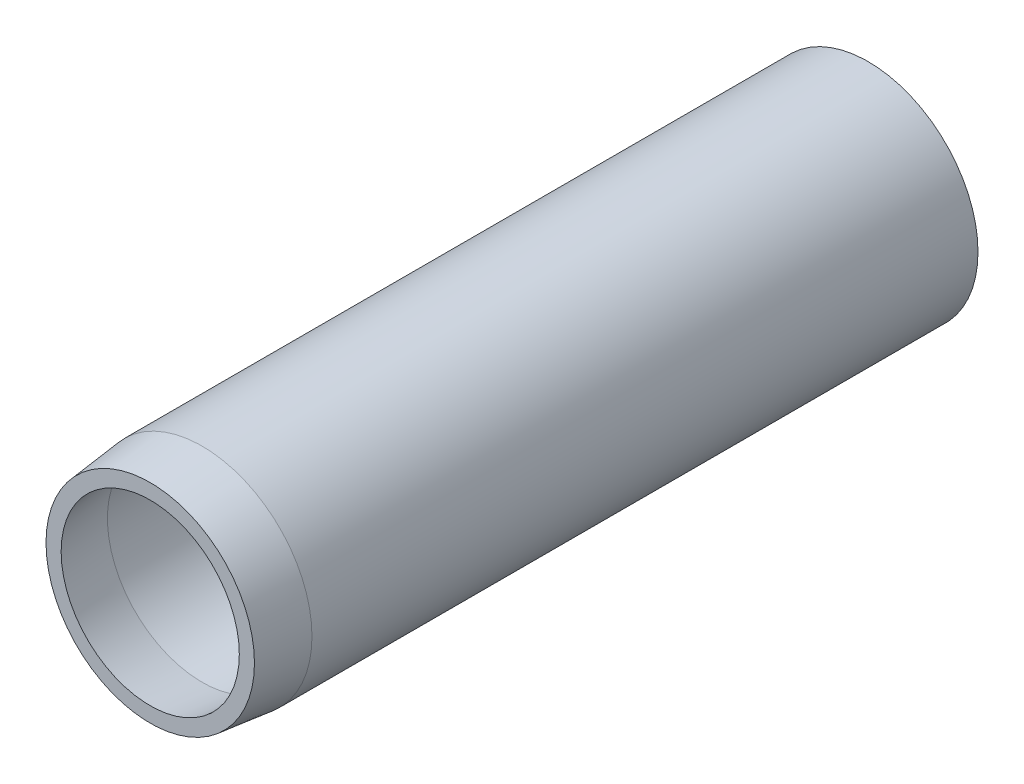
from build123d import *


with BuildPart() as part:
    # Sketch1 → Revolve1 (revolve)
    with BuildSketch(Plane(origin=(0, 0, 0), x_dir=(0, 0, -1), z_dir=(1, 0, 0)), mode=Mode.PRIVATE) as revolve1_sk:
        Polygon((0, 1.53035), (0.762, 1.6129), (10.541, 1.6129), (10.541, 1.143), (10.029661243, 0.6985), (9.525, 0.6985), (9.525, 1.39065), (0.762, 1.39065), (0, 1.3081), align=None)
    revolve(revolve1_sk.sketch.rotate(Axis((0, 0, 15.760192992), (0, 0, -1)), 90), axis=Axis((0, 0, 15.760192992), (0, 0, -1)))


solid = part.part
